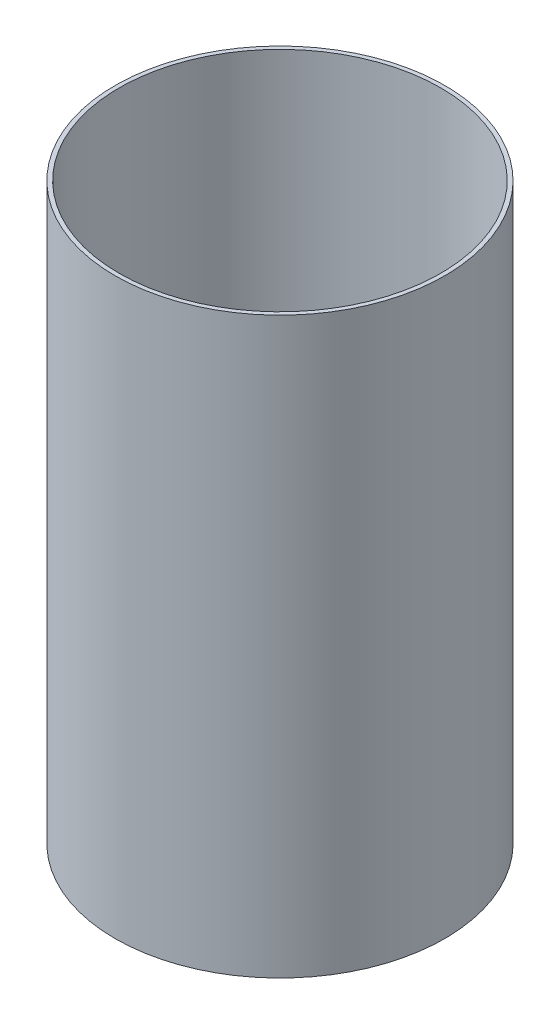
ISO-10303-21;
HEADER;
FILE_DESCRIPTION(('STEP AP214'),'2;1');
FILE_NAME('part.step','',(''),(''),'','','');
FILE_SCHEMA(('AUTOMOTIVE_DESIGN { 1 0 10303 214 1 1 1 1 }'));
ENDSEC;
DATA;
#1=APPLICATION_CONTEXT('core data for automotive mechanical design processes');
#2=APPLICATION_PROTOCOL_DEFINITION('international standard','automotive_design',2000,#1);
#3=PRODUCT_CONTEXT('',#1,'mechanical');
#4=PRODUCT('Part','Part','',(#3));
#5=PRODUCT_RELATED_PRODUCT_CATEGORY('part','',(#4));
#6=PRODUCT_DEFINITION_FORMATION('','',#4);
#7=PRODUCT_DEFINITION_CONTEXT('part definition',#1,'design');
#8=PRODUCT_DEFINITION('design','',#6,#7);
#9=PRODUCT_DEFINITION_SHAPE('','',#8);
#10=(LENGTH_UNIT() NAMED_UNIT(*) SI_UNIT(.MILLI.,.METRE.));
#11=(NAMED_UNIT(*) PLANE_ANGLE_UNIT() SI_UNIT($,.RADIAN.));
#12=(NAMED_UNIT(*) SI_UNIT($,.STERADIAN.) SOLID_ANGLE_UNIT());
#13=UNCERTAINTY_MEASURE_WITH_UNIT(LENGTH_MEASURE(1.E-05),#10,'distance_accuracy_value','');
#14=(GEOMETRIC_REPRESENTATION_CONTEXT(3) GLOBAL_UNCERTAINTY_ASSIGNED_CONTEXT((#13)) GLOBAL_UNIT_ASSIGNED_CONTEXT((#10,
#11,#12)) REPRESENTATION_CONTEXT('',''));
#15=CARTESIAN_POINT('',(0.,0.,0.));
#16=DIRECTION('',(0.,0.,1.));
#17=DIRECTION('',(1.,0.,0.));
#18=AXIS2_PLACEMENT_3D('',#15,#16,#17);
#19=CARTESIAN_POINT('',(0.,17.5,0.));
#20=DIRECTION('',(0.,1.,0.));
#21=DIRECTION('',(0.,0.,1.));
#22=AXIS2_PLACEMENT_3D('',#19,#20,#21);
#23=PLANE('',#22);
#24=CARTESIAN_POINT('',(0.,17.5,0.));
#25=DIRECTION('',(0.,1.,0.));
#26=DIRECTION('',(0.,0.,1.));
#27=AXIS2_PLACEMENT_3D('',#24,#25,#26);
#28=CIRCLE('',#27,10.05);
#29=CARTESIAN_POINT('',(0.,17.5,10.05));
#30=VERTEX_POINT('',#29);
#31=EDGE_CURVE('E10',#30,#30,#28,.T.);
#32=ORIENTED_EDGE('',*,*,#31,.T.);
#33=EDGE_LOOP('',(#32));
#34=FACE_BOUND('',#33,.T.);
#35=CARTESIAN_POINT('',(0.,17.5,0.));
#36=DIRECTION('',(0.,1.,0.));
#37=DIRECTION('',(0.,0.,1.));
#38=AXIS2_PLACEMENT_3D('',#35,#36,#37);
#39=CIRCLE('',#38,9.8);
#40=CARTESIAN_POINT('',(0.,17.5,9.8));
#41=VERTEX_POINT('',#40);
#42=EDGE_CURVE('E46',#41,#41,#39,.T.);
#43=ORIENTED_EDGE('',*,*,#42,.F.);
#44=EDGE_LOOP('',(#43));
#45=FACE_BOUND('',#44,.T.);
#46=ADVANCED_FACE('F35',(#34,#45),#23,.T.);
#47=CARTESIAN_POINT('',(0.,-17.5,0.));
#48=DIRECTION('',(0.,1.,0.));
#49=DIRECTION('',(0.,0.,1.));
#50=AXIS2_PLACEMENT_3D('',#47,#48,#49);
#51=PLANE('',#50);
#52=CARTESIAN_POINT('',(0.,-17.5,0.));
#53=DIRECTION('',(0.,1.,0.));
#54=DIRECTION('',(0.,0.,1.));
#55=AXIS2_PLACEMENT_3D('',#52,#53,#54);
#56=CIRCLE('',#55,10.05);
#57=CARTESIAN_POINT('',(0.,-17.5,10.05));
#58=VERTEX_POINT('',#57);
#59=EDGE_CURVE('E39',#58,#58,#56,.T.);
#60=ORIENTED_EDGE('',*,*,#59,.F.);
#61=EDGE_LOOP('',(#60));
#62=FACE_BOUND('',#61,.T.);
#63=CARTESIAN_POINT('',(0.,-17.5,0.));
#64=DIRECTION('',(0.,1.,0.));
#65=DIRECTION('',(0.,0.,1.));
#66=AXIS2_PLACEMENT_3D('',#63,#64,#65);
#67=CIRCLE('',#66,9.8);
#68=CARTESIAN_POINT('',(0.,-17.5,9.8));
#69=VERTEX_POINT('',#68);
#70=EDGE_CURVE('E48',#69,#69,#67,.T.);
#71=ORIENTED_EDGE('',*,*,#70,.T.);
#72=EDGE_LOOP('',(#71));
#73=FACE_BOUND('',#72,.T.);
#74=ADVANCED_FACE('F58',(#62,#73),#51,.F.);
#75=CARTESIAN_POINT('',(0.,17.5,0.));
#76=DIRECTION('',(0.,-1.,0.));
#77=DIRECTION('',(0.,0.,-1.));
#78=AXIS2_PLACEMENT_3D('',#75,#76,#77);
#79=CYLINDRICAL_SURFACE('',#78,10.05);
#80=ORIENTED_EDGE('',*,*,#31,.F.);
#81=EDGE_LOOP('',(#80));
#82=FACE_BOUND('',#81,.T.);
#83=ORIENTED_EDGE('',*,*,#59,.T.);
#84=EDGE_LOOP('',(#83));
#85=FACE_BOUND('',#84,.T.);
#86=ADVANCED_FACE('F37',(#82,#85),#79,.T.);
#87=CARTESIAN_POINT('',(0.,17.5,0.));
#88=DIRECTION('',(0.,-1.,0.));
#89=DIRECTION('',(0.,0.,-1.));
#90=AXIS2_PLACEMENT_3D('',#87,#88,#89);
#91=CYLINDRICAL_SURFACE('',#90,9.8);
#92=ORIENTED_EDGE('',*,*,#42,.T.);
#93=EDGE_LOOP('',(#92));
#94=FACE_BOUND('',#93,.T.);
#95=ORIENTED_EDGE('',*,*,#70,.F.);
#96=EDGE_LOOP('',(#95));
#97=FACE_BOUND('',#96,.T.);
#98=ADVANCED_FACE('F54',(#94,#97),#91,.F.);
#99=CLOSED_SHELL('',(#46,#74,#86,#98));
#100=MANIFOLD_SOLID_BREP('B2',#99);
#101=ADVANCED_BREP_SHAPE_REPRESENTATION('',(#18,#100),#14);
#102=SHAPE_DEFINITION_REPRESENTATION(#9,#101);
ENDSEC;
END-ISO-10303-21;
